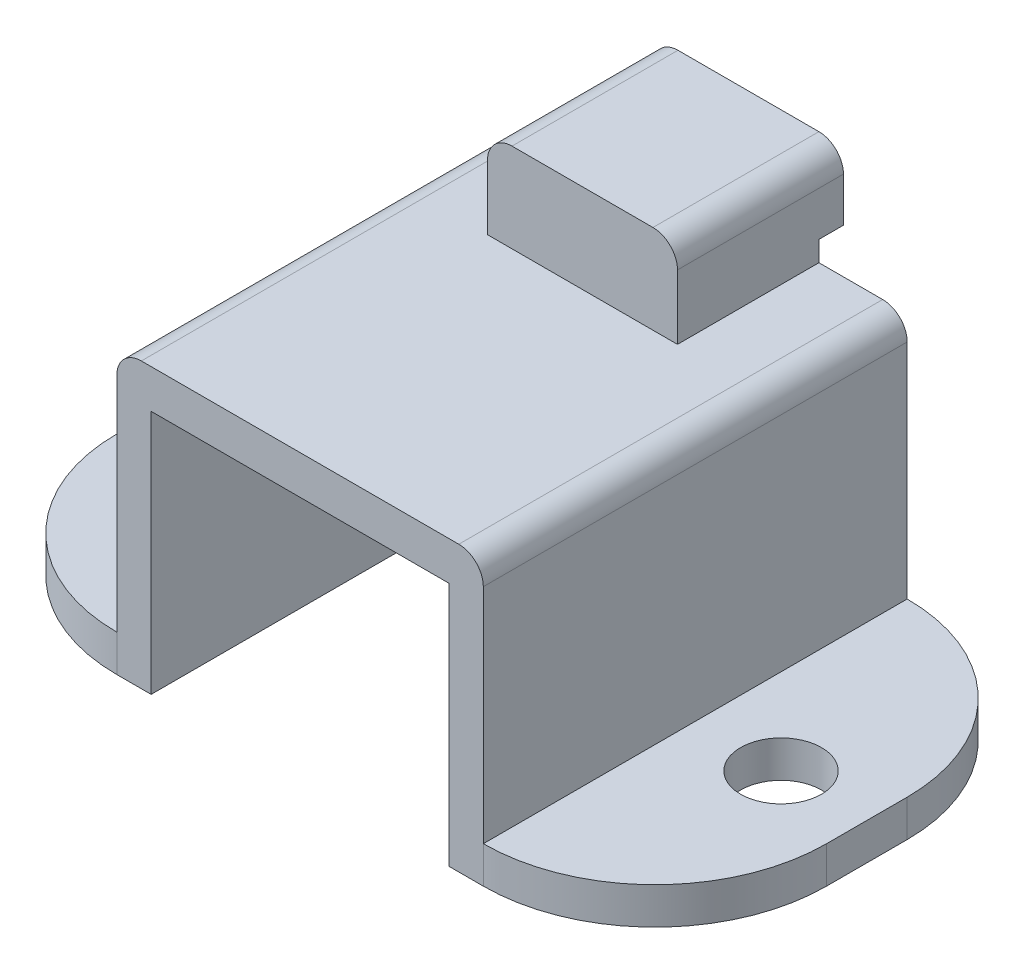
ISO-10303-21;
HEADER;
FILE_DESCRIPTION(('STEP AP214'),'2;1');
FILE_NAME('part.step','',(''),(''),'','','');
FILE_SCHEMA(('AUTOMOTIVE_DESIGN { 1 0 10303 214 1 1 1 1 }'));
ENDSEC;
DATA;
#1=APPLICATION_CONTEXT('core data for automotive mechanical design processes');
#2=APPLICATION_PROTOCOL_DEFINITION('international standard','automotive_design',2000,#1);
#3=PRODUCT_CONTEXT('',#1,'mechanical');
#4=PRODUCT('Part','Part','',(#3));
#5=PRODUCT_RELATED_PRODUCT_CATEGORY('part','',(#4));
#6=PRODUCT_DEFINITION_FORMATION('','',#4);
#7=PRODUCT_DEFINITION_CONTEXT('part definition',#1,'design');
#8=PRODUCT_DEFINITION('design','',#6,#7);
#9=PRODUCT_DEFINITION_SHAPE('','',#8);
#10=(LENGTH_UNIT() NAMED_UNIT(*) SI_UNIT(.MILLI.,.METRE.));
#11=(NAMED_UNIT(*) PLANE_ANGLE_UNIT() SI_UNIT($,.RADIAN.));
#12=(NAMED_UNIT(*) SI_UNIT($,.STERADIAN.) SOLID_ANGLE_UNIT());
#13=UNCERTAINTY_MEASURE_WITH_UNIT(LENGTH_MEASURE(1.E-05),#10,'distance_accuracy_value','');
#14=(GEOMETRIC_REPRESENTATION_CONTEXT(3) GLOBAL_UNCERTAINTY_ASSIGNED_CONTEXT((#13)) GLOBAL_UNIT_ASSIGNED_CONTEXT((#10,
#11,#12)) REPRESENTATION_CONTEXT('',''));
#15=CARTESIAN_POINT('',(0.,0.,0.));
#16=DIRECTION('',(0.,0.,1.));
#17=DIRECTION('',(1.,0.,0.));
#18=AXIS2_PLACEMENT_3D('',#15,#16,#17);
#19=CARTESIAN_POINT('',(0.,0.,-8.12));
#20=DIRECTION('',(0.,0.,-1.));
#21=DIRECTION('',(-1.,0.,0.));
#22=AXIS2_PLACEMENT_3D('',#19,#20,#21);
#23=PLANE('',#22);
#24=DIRECTION('',(0.,1.,0.));
#25=VECTOR('',#24,1.);
#26=CARTESIAN_POINT('',(-3.875,0.,-8.12));
#27=LINE('',#26,#25);
#28=CARTESIAN_POINT('',(-3.875,11.58,-8.12));
#29=VERTEX_POINT('',#28);
#30=CARTESIAN_POINT('',(-3.875,12.4038902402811,-8.12));
#31=VERTEX_POINT('',#30);
#32=EDGE_CURVE('E354',#29,#31,#27,.T.);
#33=ORIENTED_EDGE('',*,*,#32,.T.);
#34=DIRECTION('',(-1.,0.,0.));
#35=VECTOR('',#34,1.);
#36=CARTESIAN_POINT('',(0.,12.4038902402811,-8.12));
#37=LINE('',#36,#35);
#38=CARTESIAN_POINT('',(-2.375,12.4038902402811,-8.12));
#39=VERTEX_POINT('',#38);
#40=EDGE_CURVE('E57',#39,#31,#37,.T.);
#41=ORIENTED_EDGE('',*,*,#40,.F.);
#42=DIRECTION('',(0.,-1.,0.));
#43=VECTOR('',#42,1.);
#44=CARTESIAN_POINT('',(-2.375,0.,-8.12));
#45=LINE('',#44,#43);
#46=CARTESIAN_POINT('',(-2.375,10.,-8.12));
#47=VERTEX_POINT('',#46);
#48=EDGE_CURVE('E335',#39,#47,#45,.T.);
#49=ORIENTED_EDGE('',*,*,#48,.T.);
#50=DIRECTION('',(-1.,0.,0.));
#51=VECTOR('',#50,1.);
#52=CARTESIAN_POINT('',(0.,10.,-8.12));
#53=LINE('',#52,#51);
#54=CARTESIAN_POINT('',(-3.075,10.,-8.12));
#55=VERTEX_POINT('',#54);
#56=EDGE_CURVE('E339',#47,#55,#53,.T.);
#57=ORIENTED_EDGE('',*,*,#56,.T.);
#58=CARTESIAN_POINT('',(-3.075,7.,-8.12));
#59=DIRECTION('',(0.,0.,-1.));
#60=DIRECTION('',(-1.,0.,0.));
#61=AXIS2_PLACEMENT_3D('',#58,#59,#60);
#62=CIRCLE('',#61,3.);
#63=CARTESIAN_POINT('',(-6.075,7.,-8.12));
#64=VERTEX_POINT('',#63);
#65=EDGE_CURVE('E342',#55,#64,#62,.F.);
#66=ORIENTED_EDGE('',*,*,#65,.T.);
#67=DIRECTION('',(0.,-1.,0.));
#68=VECTOR('',#67,1.);
#69=CARTESIAN_POINT('',(-6.075,0.,-8.12));
#70=LINE('',#69,#68);
#71=CARTESIAN_POINT('',(-6.075,0.,-8.12));
#72=VERTEX_POINT('',#71);
#73=EDGE_CURVE('E345',#64,#72,#70,.T.);
#74=ORIENTED_EDGE('',*,*,#73,.T.);
#75=DIRECTION('',(-1.,0.,0.));
#76=VECTOR('',#75,1.);
#77=CARTESIAN_POINT('',(0.,0.,-8.12));
#78=LINE('',#77,#76);
#79=CARTESIAN_POINT('',(-7.475,0.,-8.12));
#80=VERTEX_POINT('',#79);
#81=EDGE_CURVE('E347',#72,#80,#78,.T.);
#82=ORIENTED_EDGE('',*,*,#81,.T.);
#83=DIRECTION('',(0.,-1.,0.));
#84=VECTOR('',#83,1.);
#85=CARTESIAN_POINT('',(-7.475,1.5,-8.12));
#86=LINE('',#85,#84);
#87=CARTESIAN_POINT('',(-7.475,1.5,-8.12));
#88=VERTEX_POINT('',#87);
#89=EDGE_CURVE('E523',#80,#88,#86,.F.);
#90=ORIENTED_EDGE('',*,*,#89,.T.);
#91=DIRECTION('',(0.,1.,0.));
#92=VECTOR('',#91,1.);
#93=CARTESIAN_POINT('',(-7.475,0.,-8.12));
#94=LINE('',#93,#92);
#95=CARTESIAN_POINT('',(-7.475,10.58,-8.12));
#96=VERTEX_POINT('',#95);
#97=EDGE_CURVE('E350',#88,#96,#94,.T.);
#98=ORIENTED_EDGE('',*,*,#97,.T.);
#99=CARTESIAN_POINT('',(-6.475,10.58,-8.12));
#100=DIRECTION('',(0.,0.,-1.));
#101=DIRECTION('',(-1.,0.,0.));
#102=AXIS2_PLACEMENT_3D('',#99,#100,#101);
#103=CIRCLE('',#102,1.);
#104=CARTESIAN_POINT('',(-6.475,11.58,-8.12));
#105=VERTEX_POINT('',#104);
#106=EDGE_CURVE('E465',#96,#105,#103,.T.);
#107=ORIENTED_EDGE('',*,*,#106,.T.);
#108=DIRECTION('',(1.,0.,0.));
#109=VECTOR('',#108,1.);
#110=CARTESIAN_POINT('',(0.,11.58,-8.12));
#111=LINE('',#110,#109);
#112=EDGE_CURVE('E352',#105,#29,#111,.T.);
#113=ORIENTED_EDGE('',*,*,#112,.T.);
#114=EDGE_LOOP('',(#33,#41,#49,#57,#66,#74,#82,#90,#98,#107,#113));
#115=FACE_BOUND('',#114,.T.);
#116=ADVANCED_FACE('F42',(#115),#23,.T.);
#117=CARTESIAN_POINT('',(-7.475,11.58,9.17));
#118=DIRECTION('',(1.,0.,0.));
#119=DIRECTION('',(0.,1.,0.));
#120=AXIS2_PLACEMENT_3D('',#117,#118,#119);
#121=PLANE('',#120);
#122=DIRECTION('',(0.,0.,-1.));
#123=VECTOR('',#122,1.);
#124=CARTESIAN_POINT('',(-7.475,1.5,9.17));
#125=LINE('',#124,#123);
#126=CARTESIAN_POINT('',(-7.475,1.5,9.17));
#127=VERTEX_POINT('',#126);
#128=EDGE_CURVE('E309',#127,#88,#125,.T.);
#129=ORIENTED_EDGE('',*,*,#128,.F.);
#130=DIRECTION('',(0.,-1.,0.));
#131=VECTOR('',#130,1.);
#132=CARTESIAN_POINT('',(-7.475,11.58,9.17));
#133=LINE('',#132,#131);
#134=CARTESIAN_POINT('',(-7.475,10.58,9.17));
#135=VERTEX_POINT('',#134);
#136=EDGE_CURVE('E437',#135,#127,#133,.T.);
#137=ORIENTED_EDGE('',*,*,#136,.F.);
#138=DIRECTION('',(0.,0.,-1.));
#139=VECTOR('',#138,1.);
#140=CARTESIAN_POINT('',(-7.475,10.58,9.17));
#141=LINE('',#140,#139);
#142=EDGE_CURVE('E476',#135,#96,#141,.T.);
#143=ORIENTED_EDGE('',*,*,#142,.T.);
#144=ORIENTED_EDGE('',*,*,#97,.F.);
#145=EDGE_LOOP('',(#129,#137,#143,#144));
#146=FACE_BOUND('',#145,.T.);
#147=ADVANCED_FACE('F610',(#146),#121,.F.);
#148=CARTESIAN_POINT('',(7.475,11.58,9.17));
#149=DIRECTION('',(-1.,0.,0.));
#150=DIRECTION('',(0.,-1.,0.));
#151=AXIS2_PLACEMENT_3D('',#148,#149,#150);
#152=PLANE('',#151);
#153=DIRECTION('',(0.,0.,1.));
#154=VECTOR('',#153,1.);
#155=CARTESIAN_POINT('',(7.475,1.5,9.17));
#156=LINE('',#155,#154);
#157=CARTESIAN_POINT('',(7.475,1.5,-8.12));
#158=VERTEX_POINT('',#157);
#159=CARTESIAN_POINT('',(7.475,1.5,9.17));
#160=VERTEX_POINT('',#159);
#161=EDGE_CURVE('E324',#158,#160,#156,.T.);
#162=ORIENTED_EDGE('',*,*,#161,.F.);
#163=DIRECTION('',(0.,-1.,0.));
#164=VECTOR('',#163,1.);
#165=CARTESIAN_POINT('',(7.475,0.,-8.12));
#166=LINE('',#165,#164);
#167=CARTESIAN_POINT('',(7.475,10.58,-8.12));
#168=VERTEX_POINT('',#167);
#169=EDGE_CURVE('E360',#168,#158,#166,.T.);
#170=ORIENTED_EDGE('',*,*,#169,.F.);
#171=DIRECTION('',(0.,0.,-1.));
#172=VECTOR('',#171,1.);
#173=CARTESIAN_POINT('',(7.475,10.58,9.17));
#174=LINE('',#173,#172);
#175=CARTESIAN_POINT('',(7.475,10.58,9.17));
#176=VERTEX_POINT('',#175);
#177=EDGE_CURVE('E469',#168,#176,#174,.F.);
#178=ORIENTED_EDGE('',*,*,#177,.T.);
#179=DIRECTION('',(0.,1.,0.));
#180=VECTOR('',#179,1.);
#181=CARTESIAN_POINT('',(7.475,11.58,9.17));
#182=LINE('',#181,#180);
#183=EDGE_CURVE('E432',#160,#176,#182,.T.);
#184=ORIENTED_EDGE('',*,*,#183,.F.);
#185=EDGE_LOOP('',(#162,#170,#178,#184));
#186=FACE_BOUND('',#185,.T.);
#187=ADVANCED_FACE('F577',(#186),#152,.F.);
#188=CARTESIAN_POINT('',(6.075,10.,9.17));
#189=DIRECTION('',(0.,1.,0.));
#190=DIRECTION('',(0.,0.,1.));
#191=AXIS2_PLACEMENT_3D('',#188,#189,#190);
#192=PLANE('',#191);
#193=DIRECTION('',(0.,0.,1.));
#194=VECTOR('',#193,1.);
#195=CARTESIAN_POINT('',(-3.075,10.,-2.35));
#196=LINE('',#195,#194);
#197=CARTESIAN_POINT('',(-3.075,10.,0.));
#198=VERTEX_POINT('',#197);
#199=EDGE_CURVE('E412',#55,#198,#196,.T.);
#200=ORIENTED_EDGE('',*,*,#199,.F.);
#201=ORIENTED_EDGE('',*,*,#56,.F.);
#202=DIRECTION('',(0.,0.,1.));
#203=VECTOR('',#202,1.);
#204=CARTESIAN_POINT('',(-2.375,10.,-8.12));
#205=LINE('',#204,#203);
#206=CARTESIAN_POINT('',(-2.375,10.,-3.42));
#207=VERTEX_POINT('',#206);
#208=EDGE_CURVE('E376',#47,#207,#205,.T.);
#209=ORIENTED_EDGE('',*,*,#208,.T.);
#210=DIRECTION('',(1.,0.,0.));
#211=VECTOR('',#210,1.);
#212=CARTESIAN_POINT('',(3.875,10.,-3.42));
#213=LINE('',#212,#211);
#214=CARTESIAN_POINT('',(2.375,10.,-3.42));
#215=VERTEX_POINT('',#214);
#216=EDGE_CURVE('E389',#207,#215,#213,.T.);
#217=ORIENTED_EDGE('',*,*,#216,.T.);
#218=DIRECTION('',(0.,0.,1.));
#219=VECTOR('',#218,1.);
#220=CARTESIAN_POINT('',(2.375,10.,-8.12));
#221=LINE('',#220,#219);
#222=CARTESIAN_POINT('',(2.375,10.,-8.12));
#223=VERTEX_POINT('',#222);
#224=EDGE_CURVE('E372',#223,#215,#221,.T.);
#225=ORIENTED_EDGE('',*,*,#224,.F.);
#226=DIRECTION('',(-1.,0.,0.));
#227=VECTOR('',#226,1.);
#228=CARTESIAN_POINT('',(0.,10.,-8.12));
#229=LINE('',#228,#227);
#230=CARTESIAN_POINT('',(3.075,10.,-8.12));
#231=VERTEX_POINT('',#230);
#232=EDGE_CURVE('E370',#231,#223,#229,.T.);
#233=ORIENTED_EDGE('',*,*,#232,.F.);
#234=DIRECTION('',(0.,0.,1.));
#235=VECTOR('',#234,1.);
#236=CARTESIAN_POINT('',(3.075,10.,-2.35));
#237=LINE('',#236,#235);
#238=CARTESIAN_POINT('',(3.075,10.,0.));
#239=VERTEX_POINT('',#238);
#240=EDGE_CURVE('E414',#231,#239,#237,.T.);
#241=ORIENTED_EDGE('',*,*,#240,.T.);
#242=DIRECTION('',(1.,0.,0.));
#243=VECTOR('',#242,1.);
#244=CARTESIAN_POINT('',(6.075,10.,0.));
#245=LINE('',#244,#243);
#246=CARTESIAN_POINT('',(6.075,10.,0.));
#247=VERTEX_POINT('',#246);
#248=EDGE_CURVE('E443',#239,#247,#245,.T.);
#249=ORIENTED_EDGE('',*,*,#248,.T.);
#250=DIRECTION('',(0.,0.,-1.));
#251=VECTOR('',#250,1.);
#252=CARTESIAN_POINT('',(6.075,10.,9.17));
#253=LINE('',#252,#251);
#254=CARTESIAN_POINT('',(6.075,10.,9.17));
#255=VERTEX_POINT('',#254);
#256=EDGE_CURVE('E451',#255,#247,#253,.T.);
#257=ORIENTED_EDGE('',*,*,#256,.F.);
#258=DIRECTION('',(1.,0.,0.));
#259=VECTOR('',#258,1.);
#260=CARTESIAN_POINT('',(6.075,10.,9.17));
#261=LINE('',#260,#259);
#262=CARTESIAN_POINT('',(-6.075,10.,9.17));
#263=VERTEX_POINT('',#262);
#264=EDGE_CURVE('E425',#263,#255,#261,.T.);
#265=ORIENTED_EDGE('',*,*,#264,.F.);
#266=DIRECTION('',(0.,0.,-1.));
#267=VECTOR('',#266,1.);
#268=CARTESIAN_POINT('',(-6.075,10.,9.17));
#269=LINE('',#268,#267);
#270=CARTESIAN_POINT('',(-6.075,10.,0.));
#271=VERTEX_POINT('',#270);
#272=EDGE_CURVE('E454',#263,#271,#269,.T.);
#273=ORIENTED_EDGE('',*,*,#272,.T.);
#274=EDGE_CURVE('E444',#271,#198,#245,.T.);
#275=ORIENTED_EDGE('',*,*,#274,.T.);
#276=EDGE_LOOP('',(#200,#201,#209,#217,#225,#233,#241,#249,#257,#265,#273,#275));
#277=FACE_BOUND('',#276,.T.);
#278=ADVANCED_FACE('F633',(#277),#192,.F.);
#279=CARTESIAN_POINT('',(-3.875,10.,-2.35));
#280=DIRECTION('',(1.,0.,0.));
#281=DIRECTION('',(0.,1.,0.));
#282=AXIS2_PLACEMENT_3D('',#279,#280,#281);
#283=PLANE('',#282);
#284=DIRECTION('',(0.,-1.,0.));
#285=VECTOR('',#284,1.);
#286=CARTESIAN_POINT('',(-3.875,10.,-2.35));
#287=LINE('',#286,#285);
#288=CARTESIAN_POINT('',(-3.875,14.21,-2.35));
#289=VERTEX_POINT('',#288);
#290=CARTESIAN_POINT('',(-3.875,11.58,-2.35));
#291=VERTEX_POINT('',#290);
#292=EDGE_CURVE('E390',#289,#291,#287,.T.);
#293=ORIENTED_EDGE('',*,*,#292,.F.);
#294=DIRECTION('',(0.,0.,-1.));
#295=VECTOR('',#294,1.);
#296=CARTESIAN_POINT('',(-3.875,14.21,-2.35));
#297=LINE('',#296,#295);
#298=CARTESIAN_POINT('',(-3.875,14.21,-9.12));
#299=VERTEX_POINT('',#298);
#300=EDGE_CURVE('E479',#289,#299,#297,.T.);
#301=ORIENTED_EDGE('',*,*,#300,.T.);
#302=DIRECTION('',(0.,1.,0.));
#303=VECTOR('',#302,1.);
#304=CARTESIAN_POINT('',(-3.875,0.,-9.12));
#305=LINE('',#304,#303);
#306=CARTESIAN_POINT('',(-3.875,12.4038902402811,-9.12));
#307=VERTEX_POINT('',#306);
#308=EDGE_CURVE('E279',#307,#299,#305,.T.);
#309=ORIENTED_EDGE('',*,*,#308,.F.);
#310=DIRECTION('',(0.,0.,1.));
#311=VECTOR('',#310,1.);
#312=CARTESIAN_POINT('',(-3.875,12.4038902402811,-9.12));
#313=LINE('',#312,#311);
#314=EDGE_CURVE('E275',#307,#31,#313,.T.);
#315=ORIENTED_EDGE('',*,*,#314,.T.);
#316=ORIENTED_EDGE('',*,*,#32,.F.);
#317=DIRECTION('',(0.,0.,-1.));
#318=VECTOR('',#317,1.);
#319=CARTESIAN_POINT('',(-3.875,11.58,-2.35));
#320=LINE('',#319,#318);
#321=EDGE_CURVE('E375',#291,#29,#320,.T.);
#322=ORIENTED_EDGE('',*,*,#321,.F.);
#323=EDGE_LOOP('',(#293,#301,#309,#315,#316,#322));
#324=FACE_BOUND('',#323,.T.);
#325=ADVANCED_FACE('F601',(#324),#283,.F.);
#326=CARTESIAN_POINT('',(3.875,15.21,-2.35));
#327=DIRECTION('',(-1.,0.,0.));
#328=DIRECTION('',(0.,-1.,0.));
#329=AXIS2_PLACEMENT_3D('',#326,#327,#328);
#330=PLANE('',#329);
#331=DIRECTION('',(0.,1.,0.));
#332=VECTOR('',#331,1.);
#333=CARTESIAN_POINT('',(3.875,0.,-8.12));
#334=LINE('',#333,#332);
#335=CARTESIAN_POINT('',(3.875,11.58,-8.12));
#336=VERTEX_POINT('',#335);
#337=CARTESIAN_POINT('',(3.875,12.4038902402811,-8.12));
#338=VERTEX_POINT('',#337);
#339=EDGE_CURVE('E294',#336,#338,#334,.T.);
#340=ORIENTED_EDGE('',*,*,#339,.T.);
#341=DIRECTION('',(0.,0.,1.));
#342=VECTOR('',#341,1.);
#343=CARTESIAN_POINT('',(3.875,12.4038902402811,-9.12));
#344=LINE('',#343,#342);
#345=CARTESIAN_POINT('',(3.875,12.4038902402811,-9.12));
#346=VERTEX_POINT('',#345);
#347=EDGE_CURVE('E273',#346,#338,#344,.T.);
#348=ORIENTED_EDGE('',*,*,#347,.F.);
#349=DIRECTION('',(0.,-1.,0.));
#350=VECTOR('',#349,1.);
#351=CARTESIAN_POINT('',(3.875,0.,-9.12));
#352=LINE('',#351,#350);
#353=CARTESIAN_POINT('',(3.875,14.21,-9.12));
#354=VERTEX_POINT('',#353);
#355=EDGE_CURVE('E280',#354,#346,#352,.T.);
#356=ORIENTED_EDGE('',*,*,#355,.F.);
#357=DIRECTION('',(0.,0.,-1.));
#358=VECTOR('',#357,1.);
#359=CARTESIAN_POINT('',(3.875,14.21,-2.35));
#360=LINE('',#359,#358);
#361=CARTESIAN_POINT('',(3.875,14.21,-2.35));
#362=VERTEX_POINT('',#361);
#363=EDGE_CURVE('E489',#354,#362,#360,.F.);
#364=ORIENTED_EDGE('',*,*,#363,.T.);
#365=DIRECTION('',(0.,1.,0.));
#366=VECTOR('',#365,1.);
#367=CARTESIAN_POINT('',(3.875,15.21,-2.35));
#368=LINE('',#367,#366);
#369=CARTESIAN_POINT('',(3.875,11.58,-2.35));
#370=VERTEX_POINT('',#369);
#371=EDGE_CURVE('E392',#370,#362,#368,.T.);
#372=ORIENTED_EDGE('',*,*,#371,.F.);
#373=DIRECTION('',(0.,0.,1.));
#374=VECTOR('',#373,1.);
#375=CARTESIAN_POINT('',(3.875,11.58,-8.12));
#376=LINE('',#375,#374);
#377=EDGE_CURVE('E383',#336,#370,#376,.T.);
#378=ORIENTED_EDGE('',*,*,#377,.F.);
#379=EDGE_LOOP('',(#340,#348,#356,#364,#372,#378));
#380=FACE_BOUND('',#379,.T.);
#381=ADVANCED_FACE('F292',(#380),#330,.F.);
#382=CARTESIAN_POINT('',(-7.475,0.,9.17));
#383=DIRECTION('',(0.,1.,0.));
#384=DIRECTION('',(-1.,0.,0.));
#385=AXIS2_PLACEMENT_3D('',#382,#383,#384);
#386=PLANE('',#385);
#387=DIRECTION('',(0.,0.,1.));
#388=VECTOR('',#387,1.);
#389=CARTESIAN_POINT('',(-14.475,0.,9.17));
#390=LINE('',#389,#388);
#391=CARTESIAN_POINT('',(-14.475,0.,-1.12));
#392=VERTEX_POINT('',#391);
#393=CARTESIAN_POINT('',(-14.475,0.,2.17));
#394=VERTEX_POINT('',#393);
#395=EDGE_CURVE('E304',#392,#394,#390,.T.);
#396=ORIENTED_EDGE('',*,*,#395,.F.);
#397=CARTESIAN_POINT('',(-7.475,0.,-1.12));
#398=DIRECTION('',(0.,1.,0.));
#399=DIRECTION('',(-1.,0.,0.));
#400=AXIS2_PLACEMENT_3D('',#397,#398,#399);
#401=CIRCLE('',#400,7.);
#402=EDGE_CURVE('E518',#392,#80,#401,.F.);
#403=ORIENTED_EDGE('',*,*,#402,.T.);
#404=ORIENTED_EDGE('',*,*,#81,.F.);
#405=DIRECTION('',(0.,0.,-1.));
#406=VECTOR('',#405,1.);
#407=CARTESIAN_POINT('',(-6.075,0.,9.17));
#408=LINE('',#407,#406);
#409=CARTESIAN_POINT('',(-6.075,0.,9.17));
#410=VERTEX_POINT('',#409);
#411=EDGE_CURVE('E457',#410,#72,#408,.T.);
#412=ORIENTED_EDGE('',*,*,#411,.F.);
#413=DIRECTION('',(1.,0.,0.));
#414=VECTOR('',#413,1.);
#415=CARTESIAN_POINT('',(-7.475,0.,9.17));
#416=LINE('',#415,#414);
#417=CARTESIAN_POINT('',(-7.475,0.,9.17));
#418=VERTEX_POINT('',#417);
#419=EDGE_CURVE('E420',#418,#410,#416,.T.);
#420=ORIENTED_EDGE('',*,*,#419,.F.);
#421=CARTESIAN_POINT('',(-7.475,0.,2.17));
#422=DIRECTION('',(0.,1.,0.));
#423=DIRECTION('',(-1.,0.,0.));
#424=AXIS2_PLACEMENT_3D('',#421,#422,#423);
#425=CIRCLE('',#424,7.);
#426=EDGE_CURVE('E516',#418,#394,#425,.F.);
#427=ORIENTED_EDGE('',*,*,#426,.T.);
#428=EDGE_LOOP('',(#396,#403,#404,#412,#420,#427));
#429=FACE_BOUND('',#428,.T.);
#430=CARTESIAN_POINT('',(-10.975,0.,0.524999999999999));
#431=DIRECTION('',(0.,1.,0.));
#432=DIRECTION('',(-1.,0.,0.));
#433=AXIS2_PLACEMENT_3D('',#430,#431,#432);
#434=CIRCLE('',#433,1.65);
#435=CARTESIAN_POINT('',(-12.625,0.,0.524999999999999));
#436=VERTEX_POINT('',#435);
#437=EDGE_CURVE('E295',#436,#436,#434,.T.);
#438=ORIENTED_EDGE('',*,*,#437,.T.);
#439=EDGE_LOOP('',(#438));
#440=FACE_BOUND('',#439,.T.);
#441=ADVANCED_FACE('F625',(#429,#440),#386,.F.);
#442=CARTESIAN_POINT('',(-6.075,0.,9.17));
#443=DIRECTION('',(-1.,0.,0.));
#444=DIRECTION('',(0.,0.,1.));
#445=AXIS2_PLACEMENT_3D('',#442,#443,#444);
#446=PLANE('',#445);
#447=ORIENTED_EDGE('',*,*,#411,.T.);
#448=ORIENTED_EDGE('',*,*,#73,.F.);
#449=DIRECTION('',(0.,0.,1.));
#450=VECTOR('',#449,1.);
#451=CARTESIAN_POINT('',(-6.075,7.,-2.35));
#452=LINE('',#451,#450);
#453=CARTESIAN_POINT('',(-6.075,7.,0.));
#454=VERTEX_POINT('',#453);
#455=EDGE_CURVE('E404',#64,#454,#452,.T.);
#456=ORIENTED_EDGE('',*,*,#455,.T.);
#457=DIRECTION('',(0.,1.,0.));
#458=VECTOR('',#457,1.);
#459=CARTESIAN_POINT('',(-6.075,0.,0.));
#460=LINE('',#459,#458);
#461=EDGE_CURVE('E419',#454,#271,#460,.T.);
#462=ORIENTED_EDGE('',*,*,#461,.T.);
#463=ORIENTED_EDGE('',*,*,#272,.F.);
#464=DIRECTION('',(0.,1.,0.));
#465=VECTOR('',#464,1.);
#466=CARTESIAN_POINT('',(-6.075,0.,9.17));
#467=LINE('',#466,#465);
#468=EDGE_CURVE('E422',#410,#263,#467,.T.);
#469=ORIENTED_EDGE('',*,*,#468,.F.);
#470=EDGE_LOOP('',(#447,#448,#456,#462,#463,#469));
#471=FACE_BOUND('',#470,.T.);
#472=ADVANCED_FACE('F630',(#471),#446,.F.);
#473=CARTESIAN_POINT('',(6.075,0.,9.17));
#474=DIRECTION('',(1.,0.,0.));
#475=DIRECTION('',(0.,0.,-1.));
#476=AXIS2_PLACEMENT_3D('',#473,#474,#475);
#477=PLANE('',#476);
#478=DIRECTION('',(0.,0.,-1.));
#479=VECTOR('',#478,1.);
#480=CARTESIAN_POINT('',(6.075,0.,9.17));
#481=LINE('',#480,#479);
#482=CARTESIAN_POINT('',(6.075,0.,9.17));
#483=VERTEX_POINT('',#482);
#484=CARTESIAN_POINT('',(6.075,0.,-8.12));
#485=VERTEX_POINT('',#484);
#486=EDGE_CURVE('E440',#483,#485,#481,.T.);
#487=ORIENTED_EDGE('',*,*,#486,.F.);
#488=DIRECTION('',(0.,-1.,0.));
#489=VECTOR('',#488,1.);
#490=CARTESIAN_POINT('',(6.075,0.,9.17));
#491=LINE('',#490,#489);
#492=EDGE_CURVE('E427',#255,#483,#491,.T.);
#493=ORIENTED_EDGE('',*,*,#492,.F.);
#494=ORIENTED_EDGE('',*,*,#256,.T.);
#495=DIRECTION('',(0.,-1.,0.));
#496=VECTOR('',#495,1.);
#497=CARTESIAN_POINT('',(6.075,0.,0.));
#498=LINE('',#497,#496);
#499=CARTESIAN_POINT('',(6.075,7.,0.));
#500=VERTEX_POINT('',#499);
#501=EDGE_CURVE('E423',#247,#500,#498,.T.);
#502=ORIENTED_EDGE('',*,*,#501,.T.);
#503=DIRECTION('',(0.,0.,1.));
#504=VECTOR('',#503,1.);
#505=CARTESIAN_POINT('',(6.075,7.,-2.35));
#506=LINE('',#505,#504);
#507=CARTESIAN_POINT('',(6.075,7.,-8.12));
#508=VERTEX_POINT('',#507);
#509=EDGE_CURVE('E417',#508,#500,#506,.T.);
#510=ORIENTED_EDGE('',*,*,#509,.F.);
#511=DIRECTION('',(0.,1.,0.));
#512=VECTOR('',#511,1.);
#513=CARTESIAN_POINT('',(6.075,0.,-8.12));
#514=LINE('',#513,#512);
#515=EDGE_CURVE('E365',#485,#508,#514,.T.);
#516=ORIENTED_EDGE('',*,*,#515,.F.);
#517=EDGE_LOOP('',(#487,#493,#494,#502,#510,#516));
#518=FACE_BOUND('',#517,.T.);
#519=ADVANCED_FACE('F569',(#518),#477,.F.);
#520=CARTESIAN_POINT('',(6.075,0.,9.17));
#521=DIRECTION('',(0.,1.,0.));
#522=DIRECTION('',(-1.,0.,0.));
#523=AXIS2_PLACEMENT_3D('',#520,#521,#522);
#524=PLANE('',#523);
#525=DIRECTION('',(-1.,0.,0.));
#526=VECTOR('',#525,1.);
#527=CARTESIAN_POINT('',(0.,0.,-8.12));
#528=LINE('',#527,#526);
#529=CARTESIAN_POINT('',(7.475,0.,-8.12));
#530=VERTEX_POINT('',#529);
#531=EDGE_CURVE('E363',#530,#485,#528,.T.);
#532=ORIENTED_EDGE('',*,*,#531,.F.);
#533=CARTESIAN_POINT('',(7.475,0.,-1.12));
#534=DIRECTION('',(0.,1.,0.));
#535=DIRECTION('',(-1.,0.,0.));
#536=AXIS2_PLACEMENT_3D('',#533,#534,#535);
#537=CIRCLE('',#536,7.);
#538=CARTESIAN_POINT('',(14.475,0.,-1.12));
#539=VERTEX_POINT('',#538);
#540=EDGE_CURVE('E536',#530,#539,#537,.F.);
#541=ORIENTED_EDGE('',*,*,#540,.T.);
#542=DIRECTION('',(0.,0.,1.));
#543=VECTOR('',#542,1.);
#544=CARTESIAN_POINT('',(14.475,0.,9.17));
#545=LINE('',#544,#543);
#546=CARTESIAN_POINT('',(14.475,0.,2.17));
#547=VERTEX_POINT('',#546);
#548=EDGE_CURVE('E318',#539,#547,#545,.T.);
#549=ORIENTED_EDGE('',*,*,#548,.T.);
#550=CARTESIAN_POINT('',(7.475,0.,2.17));
#551=DIRECTION('',(0.,1.,0.));
#552=DIRECTION('',(-1.,0.,0.));
#553=AXIS2_PLACEMENT_3D('',#550,#551,#552);
#554=CIRCLE('',#553,7.);
#555=CARTESIAN_POINT('',(7.475,0.,9.17));
#556=VERTEX_POINT('',#555);
#557=EDGE_CURVE('E534',#547,#556,#554,.F.);
#558=ORIENTED_EDGE('',*,*,#557,.T.);
#559=DIRECTION('',(1.,0.,0.));
#560=VECTOR('',#559,1.);
#561=CARTESIAN_POINT('',(6.075,0.,9.17));
#562=LINE('',#561,#560);
#563=EDGE_CURVE('E429',#483,#556,#562,.T.);
#564=ORIENTED_EDGE('',*,*,#563,.F.);
#565=ORIENTED_EDGE('',*,*,#486,.T.);
#566=EDGE_LOOP('',(#532,#541,#549,#558,#564,#565));
#567=FACE_BOUND('',#566,.T.);
#568=CARTESIAN_POINT('',(10.975,0.,0.524999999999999));
#569=DIRECTION('',(0.,-1.,0.));
#570=DIRECTION('',(1.,0.,0.));
#571=AXIS2_PLACEMENT_3D('',#568,#569,#570);
#572=CIRCLE('',#571,1.65);
#573=CARTESIAN_POINT('',(12.625,0.,0.524999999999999));
#574=VERTEX_POINT('',#573);
#575=EDGE_CURVE('E314',#574,#574,#572,.T.);
#576=ORIENTED_EDGE('',*,*,#575,.F.);
#577=EDGE_LOOP('',(#576));
#578=FACE_BOUND('',#577,.T.);
#579=ADVANCED_FACE('F558',(#567,#578),#524,.F.);
#580=CARTESIAN_POINT('',(-7.475,11.58,9.17));
#581=DIRECTION('',(0.,-1.,0.));
#582=DIRECTION('',(0.,0.,-1.));
#583=AXIS2_PLACEMENT_3D('',#580,#581,#582);
#584=PLANE('',#583);
#585=DIRECTION('',(-1.,0.,0.));
#586=VECTOR('',#585,1.);
#587=CARTESIAN_POINT('',(-7.475,11.58,9.17));
#588=LINE('',#587,#586);
#589=CARTESIAN_POINT('',(6.475,11.58,9.17));
#590=VERTEX_POINT('',#589);
#591=CARTESIAN_POINT('',(-6.475,11.58,9.17));
#592=VERTEX_POINT('',#591);
#593=EDGE_CURVE('E434',#590,#592,#588,.T.);
#594=ORIENTED_EDGE('',*,*,#593,.F.);
#595=DIRECTION('',(0.,0.,-1.));
#596=VECTOR('',#595,1.);
#597=CARTESIAN_POINT('',(6.475,11.58,9.17));
#598=LINE('',#597,#596);
#599=CARTESIAN_POINT('',(6.475,11.58,-8.12));
#600=VERTEX_POINT('',#599);
#601=EDGE_CURVE('E462',#590,#600,#598,.T.);
#602=ORIENTED_EDGE('',*,*,#601,.T.);
#603=DIRECTION('',(1.,0.,0.));
#604=VECTOR('',#603,1.);
#605=CARTESIAN_POINT('',(0.,11.58,-8.12));
#606=LINE('',#605,#604);
#607=EDGE_CURVE('E357',#336,#600,#606,.T.);
#608=ORIENTED_EDGE('',*,*,#607,.F.);
#609=ORIENTED_EDGE('',*,*,#377,.T.);
#610=DIRECTION('',(1.,0.,0.));
#611=VECTOR('',#610,1.);
#612=CARTESIAN_POINT('',(-7.475,11.58,-2.35));
#613=LINE('',#612,#611);
#614=EDGE_CURVE('E401',#291,#370,#613,.T.);
#615=ORIENTED_EDGE('',*,*,#614,.F.);
#616=ORIENTED_EDGE('',*,*,#321,.T.);
#617=ORIENTED_EDGE('',*,*,#112,.F.);
#618=DIRECTION('',(0.,0.,-1.));
#619=VECTOR('',#618,1.);
#620=CARTESIAN_POINT('',(-6.475,11.58,9.17));
#621=LINE('',#620,#619);
#622=EDGE_CURVE('E460',#105,#592,#621,.F.);
#623=ORIENTED_EDGE('',*,*,#622,.T.);
#624=EDGE_LOOP('',(#594,#602,#608,#609,#615,#616,#617,#623));
#625=FACE_BOUND('',#624,.T.);
#626=ADVANCED_FACE('F585',(#625),#584,.F.);
#627=CARTESIAN_POINT('',(0.,0.,9.17));
#628=DIRECTION('',(0.,0.,1.));
#629=DIRECTION('',(1.,0.,0.));
#630=AXIS2_PLACEMENT_3D('',#627,#628,#629);
#631=PLANE('',#630);
#632=ORIENTED_EDGE('',*,*,#136,.T.);
#633=DIRECTION('',(0.,-1.,0.));
#634=VECTOR('',#633,1.);
#635=CARTESIAN_POINT('',(-7.475,0.,9.17));
#636=LINE('',#635,#634);
#637=EDGE_CURVE('E531',#127,#418,#636,.T.);
#638=ORIENTED_EDGE('',*,*,#637,.T.);
#639=ORIENTED_EDGE('',*,*,#419,.T.);
#640=ORIENTED_EDGE('',*,*,#468,.T.);
#641=ORIENTED_EDGE('',*,*,#264,.T.);
#642=ORIENTED_EDGE('',*,*,#492,.T.);
#643=ORIENTED_EDGE('',*,*,#563,.T.);
#644=DIRECTION('',(0.,-1.,0.));
#645=VECTOR('',#644,1.);
#646=CARTESIAN_POINT('',(7.475,0.,9.17));
#647=LINE('',#646,#645);
#648=EDGE_CURVE('E529',#556,#160,#647,.F.);
#649=ORIENTED_EDGE('',*,*,#648,.T.);
#650=ORIENTED_EDGE('',*,*,#183,.T.);
#651=CARTESIAN_POINT('',(6.475,10.58,9.17));
#652=DIRECTION('',(0.,0.,1.));
#653=DIRECTION('',(1.,0.,0.));
#654=AXIS2_PLACEMENT_3D('',#651,#652,#653);
#655=CIRCLE('',#654,1.);
#656=EDGE_CURVE('E474',#176,#590,#655,.T.);
#657=ORIENTED_EDGE('',*,*,#656,.T.);
#658=ORIENTED_EDGE('',*,*,#593,.T.);
#659=CARTESIAN_POINT('',(-6.475,10.58,9.17));
#660=DIRECTION('',(0.,0.,1.));
#661=DIRECTION('',(1.,0.,0.));
#662=AXIS2_PLACEMENT_3D('',#659,#660,#661);
#663=CIRCLE('',#662,1.);
#664=EDGE_CURVE('E472',#592,#135,#663,.T.);
#665=ORIENTED_EDGE('',*,*,#664,.T.);
#666=EDGE_LOOP('',(#632,#638,#639,#640,#641,#642,#643,#649,#650,#657,#658,#665));
#667=FACE_BOUND('',#666,.T.);
#668=ADVANCED_FACE('F561',(#667),#631,.T.);
#669=CARTESIAN_POINT('',(3.075,7.,0.));
#670=DIRECTION('',(0.,0.,1.));
#671=DIRECTION('',(1.,0.,0.));
#672=AXIS2_PLACEMENT_3D('',#669,#670,#671);
#673=PLANE('',#672);
#674=ORIENTED_EDGE('',*,*,#501,.F.);
#675=ORIENTED_EDGE('',*,*,#248,.F.);
#676=CARTESIAN_POINT('',(3.075,7.,0.));
#677=DIRECTION('',(0.,0.,1.));
#678=DIRECTION('',(1.,0.,0.));
#679=AXIS2_PLACEMENT_3D('',#676,#677,#678);
#680=CIRCLE('',#679,3.);
#681=EDGE_CURVE('E398',#500,#239,#680,.T.);
#682=ORIENTED_EDGE('',*,*,#681,.F.);
#683=EDGE_LOOP('',(#674,#675,#682));
#684=FACE_BOUND('',#683,.T.);
#685=ADVANCED_FACE('F638',(#684),#673,.T.);
#686=CARTESIAN_POINT('',(3.075,7.,-2.35));
#687=DIRECTION('',(0.,0.,1.));
#688=DIRECTION('',(1.,0.,0.));
#689=AXIS2_PLACEMENT_3D('',#686,#687,#688);
#690=CYLINDRICAL_SURFACE('',#689,3.);
#691=ORIENTED_EDGE('',*,*,#681,.T.);
#692=ORIENTED_EDGE('',*,*,#240,.F.);
#693=CARTESIAN_POINT('',(3.075,7.,-8.12));
#694=DIRECTION('',(0.,0.,-1.));
#695=DIRECTION('',(-1.,0.,0.));
#696=AXIS2_PLACEMENT_3D('',#693,#694,#695);
#697=CIRCLE('',#696,3.);
#698=EDGE_CURVE('E367',#508,#231,#697,.F.);
#699=ORIENTED_EDGE('',*,*,#698,.F.);
#700=ORIENTED_EDGE('',*,*,#509,.T.);
#701=EDGE_LOOP('',(#691,#692,#699,#700));
#702=FACE_BOUND('',#701,.T.);
#703=ADVANCED_FACE('F640',(#702),#690,.F.);
#704=CARTESIAN_POINT('',(-3.075,7.,-2.35));
#705=DIRECTION('',(0.,0.,1.));
#706=DIRECTION('',(1.,0.,0.));
#707=AXIS2_PLACEMENT_3D('',#704,#705,#706);
#708=CYLINDRICAL_SURFACE('',#707,3.);
#709=CARTESIAN_POINT('',(-3.075,7.,0.));
#710=DIRECTION('',(0.,0.,1.));
#711=DIRECTION('',(1.,0.,0.));
#712=AXIS2_PLACEMENT_3D('',#709,#710,#711);
#713=CIRCLE('',#712,3.);
#714=EDGE_CURVE('E405',#198,#454,#713,.T.);
#715=ORIENTED_EDGE('',*,*,#714,.T.);
#716=ORIENTED_EDGE('',*,*,#455,.F.);
#717=ORIENTED_EDGE('',*,*,#65,.F.);
#718=ORIENTED_EDGE('',*,*,#199,.T.);
#719=EDGE_LOOP('',(#715,#716,#717,#718));
#720=FACE_BOUND('',#719,.T.);
#721=ADVANCED_FACE('F721',(#720),#708,.F.);
#722=ORIENTED_EDGE('',*,*,#274,.F.);
#723=ORIENTED_EDGE('',*,*,#461,.F.);
#724=ORIENTED_EDGE('',*,*,#714,.F.);
#725=EDGE_LOOP('',(#722,#723,#724));
#726=FACE_BOUND('',#725,.T.);
#727=ADVANCED_FACE('F709',(#726),#673,.T.);
#728=CARTESIAN_POINT('',(0.,0.,-2.35));
#729=DIRECTION('',(0.,0.,-1.));
#730=DIRECTION('',(-1.,0.,0.));
#731=AXIS2_PLACEMENT_3D('',#728,#729,#730);
#732=PLANE('',#731);
#733=DIRECTION('',(-1.,0.,0.));
#734=VECTOR('',#733,1.);
#735=CARTESIAN_POINT('',(-3.875,15.21,-2.35));
#736=LINE('',#735,#734);
#737=CARTESIAN_POINT('',(2.875,15.21,-2.35));
#738=VERTEX_POINT('',#737);
#739=CARTESIAN_POINT('',(-2.875,15.21,-2.35));
#740=VERTEX_POINT('',#739);
#741=EDGE_CURVE('E395',#738,#740,#736,.T.);
#742=ORIENTED_EDGE('',*,*,#741,.T.);
#743=CARTESIAN_POINT('',(-2.875,14.21,-2.35));
#744=DIRECTION('',(0.,0.,-1.));
#745=DIRECTION('',(-1.,0.,0.));
#746=AXIS2_PLACEMENT_3D('',#743,#744,#745);
#747=CIRCLE('',#746,1.);
#748=EDGE_CURVE('E487',#740,#289,#747,.F.);
#749=ORIENTED_EDGE('',*,*,#748,.T.);
#750=ORIENTED_EDGE('',*,*,#292,.T.);
#751=ORIENTED_EDGE('',*,*,#614,.T.);
#752=ORIENTED_EDGE('',*,*,#371,.T.);
#753=CARTESIAN_POINT('',(2.875,14.21,-2.35));
#754=DIRECTION('',(0.,0.,-1.));
#755=DIRECTION('',(-1.,0.,0.));
#756=AXIS2_PLACEMENT_3D('',#753,#754,#755);
#757=CIRCLE('',#756,1.);
#758=EDGE_CURVE('E485',#362,#738,#757,.F.);
#759=ORIENTED_EDGE('',*,*,#758,.T.);
#760=EDGE_LOOP('',(#742,#749,#750,#751,#752,#759));
#761=FACE_BOUND('',#760,.T.);
#762=ADVANCED_FACE('F594',(#761),#732,.F.);
#763=CARTESIAN_POINT('',(-3.875,15.21,-2.35));
#764=DIRECTION('',(0.,-1.,0.));
#765=DIRECTION('',(0.,0.,-1.));
#766=AXIS2_PLACEMENT_3D('',#763,#764,#765);
#767=PLANE('',#766);
#768=DIRECTION('',(0.,0.,-1.));
#769=VECTOR('',#768,1.);
#770=CARTESIAN_POINT('',(2.875,15.21,-2.35));
#771=LINE('',#770,#769);
#772=CARTESIAN_POINT('',(2.875,15.21,-9.12));
#773=VERTEX_POINT('',#772);
#774=EDGE_CURVE('E481',#738,#773,#771,.T.);
#775=ORIENTED_EDGE('',*,*,#774,.T.);
#776=DIRECTION('',(1.,0.,0.));
#777=VECTOR('',#776,1.);
#778=CARTESIAN_POINT('',(0.,15.21,-9.12));
#779=LINE('',#778,#777);
#780=CARTESIAN_POINT('',(-2.875,15.21,-9.12));
#781=VERTEX_POINT('',#780);
#782=EDGE_CURVE('E660',#781,#773,#779,.T.);
#783=ORIENTED_EDGE('',*,*,#782,.F.);
#784=DIRECTION('',(0.,0.,-1.));
#785=VECTOR('',#784,1.);
#786=CARTESIAN_POINT('',(-2.875,15.21,-2.35));
#787=LINE('',#786,#785);
#788=EDGE_CURVE('E483',#781,#740,#787,.F.);
#789=ORIENTED_EDGE('',*,*,#788,.T.);
#790=ORIENTED_EDGE('',*,*,#741,.F.);
#791=EDGE_LOOP('',(#775,#783,#789,#790));
#792=FACE_BOUND('',#791,.T.);
#793=ADVANCED_FACE('F669',(#792),#767,.F.);
#794=CARTESIAN_POINT('',(0.,0.,-3.42));
#795=DIRECTION('',(0.,0.,-1.));
#796=DIRECTION('',(-1.,0.,0.));
#797=AXIS2_PLACEMENT_3D('',#794,#795,#796);
#798=PLANE('',#797);
#799=DIRECTION('',(0.,-1.,0.));
#800=VECTOR('',#799,1.);
#801=CARTESIAN_POINT('',(-2.375,0.,-3.42));
#802=LINE('',#801,#800);
#803=CARTESIAN_POINT('',(-2.375,12.61,-3.42));
#804=VERTEX_POINT('',#803);
#805=EDGE_CURVE('E379',#804,#207,#802,.T.);
#806=ORIENTED_EDGE('',*,*,#805,.F.);
#807=CARTESIAN_POINT('',(-1.375,12.61,-3.42));
#808=DIRECTION('',(0.,0.,-1.));
#809=DIRECTION('',(-1.,0.,0.));
#810=AXIS2_PLACEMENT_3D('',#807,#808,#809);
#811=CIRCLE('',#810,1.);
#812=CARTESIAN_POINT('',(-1.375,13.61,-3.42));
#813=VERTEX_POINT('',#812);
#814=EDGE_CURVE('E496',#804,#813,#811,.T.);
#815=ORIENTED_EDGE('',*,*,#814,.T.);
#816=DIRECTION('',(-1.,0.,0.));
#817=VECTOR('',#816,1.);
#818=CARTESIAN_POINT('',(0.,13.61,-3.42));
#819=LINE('',#818,#817);
#820=CARTESIAN_POINT('',(1.375,13.61,-3.42));
#821=VERTEX_POINT('',#820);
#822=EDGE_CURVE('E329',#821,#813,#819,.T.);
#823=ORIENTED_EDGE('',*,*,#822,.F.);
#824=CARTESIAN_POINT('',(1.375,12.61,-3.42));
#825=DIRECTION('',(0.,0.,-1.));
#826=DIRECTION('',(-1.,0.,0.));
#827=AXIS2_PLACEMENT_3D('',#824,#825,#826);
#828=CIRCLE('',#827,1.);
#829=CARTESIAN_POINT('',(2.375,12.61,-3.42));
#830=VERTEX_POINT('',#829);
#831=EDGE_CURVE('E494',#821,#830,#828,.T.);
#832=ORIENTED_EDGE('',*,*,#831,.T.);
#833=DIRECTION('',(0.,-1.,0.));
#834=VECTOR('',#833,1.);
#835=CARTESIAN_POINT('',(2.375,0.,-3.42));
#836=LINE('',#835,#834);
#837=EDGE_CURVE('E373',#830,#215,#836,.T.);
#838=ORIENTED_EDGE('',*,*,#837,.T.);
#839=ORIENTED_EDGE('',*,*,#216,.F.);
#840=EDGE_LOOP('',(#806,#815,#823,#832,#838,#839));
#841=FACE_BOUND('',#840,.T.);
#842=ADVANCED_FACE('F706',(#841),#798,.T.);
#843=CARTESIAN_POINT('',(2.375,0.,-8.12));
#844=DIRECTION('',(-1.,0.,0.));
#845=DIRECTION('',(0.,-1.,0.));
#846=AXIS2_PLACEMENT_3D('',#843,#844,#845);
#847=PLANE('',#846);
#848=ORIENTED_EDGE('',*,*,#837,.F.);
#849=DIRECTION('',(0.,0.,1.));
#850=VECTOR('',#849,1.);
#851=CARTESIAN_POINT('',(2.375,12.61,-8.12));
#852=LINE('',#851,#850);
#853=CARTESIAN_POINT('',(2.375,12.61,-8.12));
#854=VERTEX_POINT('',#853);
#855=EDGE_CURVE('E503',#830,#854,#852,.F.);
#856=ORIENTED_EDGE('',*,*,#855,.T.);
#857=DIRECTION('',(0.,-1.,0.));
#858=VECTOR('',#857,1.);
#859=CARTESIAN_POINT('',(2.375,0.,-8.12));
#860=LINE('',#859,#858);
#861=CARTESIAN_POINT('',(2.375,12.4038902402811,-8.12));
#862=VERTEX_POINT('',#861);
#863=EDGE_CURVE('E330',#854,#862,#860,.T.);
#864=ORIENTED_EDGE('',*,*,#863,.T.);
#865=EDGE_CURVE('E65',#862,#223,#860,.T.);
#866=ORIENTED_EDGE('',*,*,#865,.T.);
#867=ORIENTED_EDGE('',*,*,#224,.T.);
#868=EDGE_LOOP('',(#848,#856,#864,#866,#867));
#869=FACE_BOUND('',#868,.T.);
#870=ADVANCED_FACE('F646',(#869),#847,.T.);
#871=CARTESIAN_POINT('',(0.,13.61,-8.12));
#872=DIRECTION('',(0.,1.,0.));
#873=DIRECTION('',(0.,0.,1.));
#874=AXIS2_PLACEMENT_3D('',#871,#872,#873);
#875=PLANE('',#874);
#876=ORIENTED_EDGE('',*,*,#822,.T.);
#877=DIRECTION('',(0.,0.,1.));
#878=VECTOR('',#877,1.);
#879=CARTESIAN_POINT('',(-1.375,13.61,-8.12));
#880=LINE('',#879,#878);
#881=CARTESIAN_POINT('',(-1.375,13.61,-8.12));
#882=VERTEX_POINT('',#881);
#883=EDGE_CURVE('E501',#813,#882,#880,.F.);
#884=ORIENTED_EDGE('',*,*,#883,.T.);
#885=DIRECTION('',(-1.,0.,0.));
#886=VECTOR('',#885,1.);
#887=CARTESIAN_POINT('',(0.,13.61,-8.12));
#888=LINE('',#887,#886);
#889=CARTESIAN_POINT('',(1.375,13.61,-8.12));
#890=VERTEX_POINT('',#889);
#891=EDGE_CURVE('E332',#890,#882,#888,.T.);
#892=ORIENTED_EDGE('',*,*,#891,.F.);
#893=DIRECTION('',(0.,0.,1.));
#894=VECTOR('',#893,1.);
#895=CARTESIAN_POINT('',(1.375,13.61,-8.12));
#896=LINE('',#895,#894);
#897=EDGE_CURVE('E498',#890,#821,#896,.T.);
#898=ORIENTED_EDGE('',*,*,#897,.T.);
#899=EDGE_LOOP('',(#876,#884,#892,#898));
#900=FACE_BOUND('',#899,.T.);
#901=ADVANCED_FACE('F696',(#900),#875,.F.);
#902=CARTESIAN_POINT('',(-2.375,0.,-8.12));
#903=DIRECTION('',(-1.,0.,0.));
#904=DIRECTION('',(0.,-1.,0.));
#905=AXIS2_PLACEMENT_3D('',#902,#903,#904);
#906=PLANE('',#905);
#907=CARTESIAN_POINT('',(-2.375,12.61,-8.12));
#908=VERTEX_POINT('',#907);
#909=EDGE_CURVE('E336',#908,#39,#45,.T.);
#910=ORIENTED_EDGE('',*,*,#909,.F.);
#911=DIRECTION('',(0.,0.,1.));
#912=VECTOR('',#911,1.);
#913=CARTESIAN_POINT('',(-2.375,12.61,-3.42));
#914=LINE('',#913,#912);
#915=EDGE_CURVE('E491',#908,#804,#914,.T.);
#916=ORIENTED_EDGE('',*,*,#915,.T.);
#917=ORIENTED_EDGE('',*,*,#805,.T.);
#918=ORIENTED_EDGE('',*,*,#208,.F.);
#919=ORIENTED_EDGE('',*,*,#48,.F.);
#920=EDGE_LOOP('',(#910,#916,#917,#918,#919));
#921=FACE_BOUND('',#920,.T.);
#922=ADVANCED_FACE('F690',(#921),#906,.F.);
#923=ORIENTED_EDGE('',*,*,#865,.F.);
#924=EDGE_CURVE('E289',#338,#862,#37,.T.);
#925=ORIENTED_EDGE('',*,*,#924,.F.);
#926=ORIENTED_EDGE('',*,*,#339,.F.);
#927=ORIENTED_EDGE('',*,*,#607,.T.);
#928=CARTESIAN_POINT('',(6.475,10.58,-8.12));
#929=DIRECTION('',(0.,0.,-1.));
#930=DIRECTION('',(-1.,0.,0.));
#931=AXIS2_PLACEMENT_3D('',#928,#929,#930);
#932=CIRCLE('',#931,1.);
#933=EDGE_CURVE('E467',#600,#168,#932,.T.);
#934=ORIENTED_EDGE('',*,*,#933,.T.);
#935=ORIENTED_EDGE('',*,*,#169,.T.);
#936=DIRECTION('',(0.,-1.,0.));
#937=VECTOR('',#936,1.);
#938=CARTESIAN_POINT('',(7.475,0.,-8.12));
#939=LINE('',#938,#937);
#940=EDGE_CURVE('E520',#158,#530,#939,.T.);
#941=ORIENTED_EDGE('',*,*,#940,.T.);
#942=ORIENTED_EDGE('',*,*,#531,.T.);
#943=ORIENTED_EDGE('',*,*,#515,.T.);
#944=ORIENTED_EDGE('',*,*,#698,.T.);
#945=ORIENTED_EDGE('',*,*,#232,.T.);
#946=EDGE_LOOP('',(#923,#925,#926,#927,#934,#935,#941,#942,#943,#944,#945));
#947=FACE_BOUND('',#946,.T.);
#948=ADVANCED_FACE('F571',(#947),#23,.T.);
#949=CARTESIAN_POINT('',(6.475,10.58,9.17));
#950=DIRECTION('',(0.,0.,-1.));
#951=DIRECTION('',(-1.,0.,0.));
#952=AXIS2_PLACEMENT_3D('',#949,#950,#951);
#953=CYLINDRICAL_SURFACE('',#952,1.);
#954=ORIENTED_EDGE('',*,*,#656,.F.);
#955=ORIENTED_EDGE('',*,*,#177,.F.);
#956=ORIENTED_EDGE('',*,*,#933,.F.);
#957=ORIENTED_EDGE('',*,*,#601,.F.);
#958=EDGE_LOOP('',(#954,#955,#956,#957));
#959=FACE_BOUND('',#958,.T.);
#960=ADVANCED_FACE('F589',(#959),#953,.T.);
#961=CARTESIAN_POINT('',(-6.475,10.58,9.17));
#962=DIRECTION('',(0.,0.,-1.));
#963=DIRECTION('',(-1.,0.,0.));
#964=AXIS2_PLACEMENT_3D('',#961,#962,#963);
#965=CYLINDRICAL_SURFACE('',#964,1.);
#966=ORIENTED_EDGE('',*,*,#664,.F.);
#967=ORIENTED_EDGE('',*,*,#622,.F.);
#968=ORIENTED_EDGE('',*,*,#106,.F.);
#969=ORIENTED_EDGE('',*,*,#142,.F.);
#970=EDGE_LOOP('',(#966,#967,#968,#969));
#971=FACE_BOUND('',#970,.T.);
#972=ADVANCED_FACE('F604',(#971),#965,.T.);
#973=CARTESIAN_POINT('',(-2.875,14.21,-2.35));
#974=DIRECTION('',(0.,0.,-1.));
#975=DIRECTION('',(-1.,0.,0.));
#976=AXIS2_PLACEMENT_3D('',#973,#974,#975);
#977=CYLINDRICAL_SURFACE('',#976,1.);
#978=ORIENTED_EDGE('',*,*,#748,.F.);
#979=ORIENTED_EDGE('',*,*,#788,.F.);
#980=CARTESIAN_POINT('',(-2.875,14.21,-9.12));
#981=DIRECTION('',(0.,0.,-1.));
#982=DIRECTION('',(-1.,0.,0.));
#983=AXIS2_PLACEMENT_3D('',#980,#981,#982);
#984=CIRCLE('',#983,1.);
#985=EDGE_CURVE('E658',#299,#781,#984,.T.);
#986=ORIENTED_EDGE('',*,*,#985,.F.);
#987=ORIENTED_EDGE('',*,*,#300,.F.);
#988=EDGE_LOOP('',(#978,#979,#986,#987));
#989=FACE_BOUND('',#988,.T.);
#990=ADVANCED_FACE('F671',(#989),#977,.T.);
#991=CARTESIAN_POINT('',(2.875,14.21,-2.35));
#992=DIRECTION('',(0.,0.,-1.));
#993=DIRECTION('',(-1.,0.,0.));
#994=AXIS2_PLACEMENT_3D('',#991,#992,#993);
#995=CYLINDRICAL_SURFACE('',#994,1.);
#996=ORIENTED_EDGE('',*,*,#758,.F.);
#997=ORIENTED_EDGE('',*,*,#363,.F.);
#998=CARTESIAN_POINT('',(2.875,14.21,-9.12));
#999=DIRECTION('',(0.,0.,-1.));
#1000=DIRECTION('',(-1.,0.,0.));
#1001=AXIS2_PLACEMENT_3D('',#998,#999,#1000);
#1002=CIRCLE('',#1001,1.);
#1003=EDGE_CURVE('E287',#773,#354,#1002,.T.);
#1004=ORIENTED_EDGE('',*,*,#1003,.F.);
#1005=ORIENTED_EDGE('',*,*,#774,.F.);
#1006=EDGE_LOOP('',(#996,#997,#1004,#1005));
#1007=FACE_BOUND('',#1006,.T.);
#1008=ADVANCED_FACE('F667',(#1007),#995,.T.);
#1009=CARTESIAN_POINT('',(-1.375,12.61,-8.12));
#1010=DIRECTION('',(0.,0.,-1.));
#1011=DIRECTION('',(-1.,0.,0.));
#1012=AXIS2_PLACEMENT_3D('',#1009,#1010,#1011);
#1013=CYLINDRICAL_SURFACE('',#1012,1.);
#1014=CARTESIAN_POINT('',(-1.375,12.61,-8.12));
#1015=DIRECTION('',(0.,0.,-1.));
#1016=DIRECTION('',(-1.,0.,0.));
#1017=AXIS2_PLACEMENT_3D('',#1014,#1015,#1016);
#1018=CIRCLE('',#1017,1.);
#1019=EDGE_CURVE('E505',#882,#908,#1018,.F.);
#1020=ORIENTED_EDGE('',*,*,#1019,.F.);
#1021=ORIENTED_EDGE('',*,*,#883,.F.);
#1022=ORIENTED_EDGE('',*,*,#814,.F.);
#1023=ORIENTED_EDGE('',*,*,#915,.F.);
#1024=EDGE_LOOP('',(#1020,#1021,#1022,#1023));
#1025=FACE_BOUND('',#1024,.T.);
#1026=ADVANCED_FACE('F678',(#1025),#1013,.F.);
#1027=CARTESIAN_POINT('',(1.375,12.61,-8.12));
#1028=DIRECTION('',(0.,0.,1.));
#1029=DIRECTION('',(1.,0.,0.));
#1030=AXIS2_PLACEMENT_3D('',#1027,#1028,#1029);
#1031=CYLINDRICAL_SURFACE('',#1030,1.);
#1032=CARTESIAN_POINT('',(1.375,12.61,-8.12));
#1033=DIRECTION('',(0.,0.,-1.));
#1034=DIRECTION('',(-1.,0.,0.));
#1035=AXIS2_PLACEMENT_3D('',#1032,#1033,#1034);
#1036=CIRCLE('',#1035,1.);
#1037=EDGE_CURVE('E508',#854,#890,#1036,.F.);
#1038=ORIENTED_EDGE('',*,*,#1037,.F.);
#1039=ORIENTED_EDGE('',*,*,#855,.F.);
#1040=ORIENTED_EDGE('',*,*,#831,.F.);
#1041=ORIENTED_EDGE('',*,*,#897,.F.);
#1042=EDGE_LOOP('',(#1038,#1039,#1040,#1041));
#1043=FACE_BOUND('',#1042,.T.);
#1044=ADVANCED_FACE('F844',(#1043),#1031,.F.);
#1045=CARTESIAN_POINT('',(0.,1.5,0.));
#1046=DIRECTION('',(0.,-1.,0.));
#1047=DIRECTION('',(1.,0.,0.));
#1048=AXIS2_PLACEMENT_3D('',#1045,#1046,#1047);
#1049=PLANE('',#1048);
#1050=CARTESIAN_POINT('',(10.975,1.5,0.524999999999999));
#1051=DIRECTION('',(0.,-1.,0.));
#1052=DIRECTION('',(1.,0.,0.));
#1053=AXIS2_PLACEMENT_3D('',#1050,#1051,#1052);
#1054=CIRCLE('',#1053,1.65);
#1055=CARTESIAN_POINT('',(12.625,1.5,0.524999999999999));
#1056=VERTEX_POINT('',#1055);
#1057=EDGE_CURVE('E315',#1056,#1056,#1054,.T.);
#1058=ORIENTED_EDGE('',*,*,#1057,.T.);
#1059=EDGE_LOOP('',(#1058));
#1060=FACE_BOUND('',#1059,.T.);
#1061=DIRECTION('',(0.,0.,1.));
#1062=VECTOR('',#1061,1.);
#1063=CARTESIAN_POINT('',(14.475,1.5,9.17));
#1064=LINE('',#1063,#1062);
#1065=CARTESIAN_POINT('',(14.475,1.5,-1.12));
#1066=VERTEX_POINT('',#1065);
#1067=CARTESIAN_POINT('',(14.475,1.5,2.17));
#1068=VERTEX_POINT('',#1067);
#1069=EDGE_CURVE('E321',#1066,#1068,#1064,.T.);
#1070=ORIENTED_EDGE('',*,*,#1069,.F.);
#1071=CARTESIAN_POINT('',(7.475,1.5,-1.12));
#1072=DIRECTION('',(0.,-1.,0.));
#1073=DIRECTION('',(1.,0.,0.));
#1074=AXIS2_PLACEMENT_3D('',#1071,#1072,#1073);
#1075=CIRCLE('',#1074,7.);
#1076=EDGE_CURVE('E12',#1066,#158,#1075,.F.);
#1077=ORIENTED_EDGE('',*,*,#1076,.T.);
#1078=ORIENTED_EDGE('',*,*,#161,.T.);
#1079=CARTESIAN_POINT('',(7.475,1.5,2.17));
#1080=DIRECTION('',(0.,-1.,0.));
#1081=DIRECTION('',(1.,0.,0.));
#1082=AXIS2_PLACEMENT_3D('',#1079,#1080,#1081);
#1083=CIRCLE('',#1082,7.);
#1084=EDGE_CURVE('E50',#160,#1068,#1083,.F.);
#1085=ORIENTED_EDGE('',*,*,#1084,.T.);
#1086=EDGE_LOOP('',(#1070,#1077,#1078,#1085));
#1087=FACE_BOUND('',#1086,.T.);
#1088=ADVANCED_FACE('F545',(#1060,#1087),#1049,.F.);
#1089=CARTESIAN_POINT('',(14.475,1.5,9.17));
#1090=DIRECTION('',(1.,0.,0.));
#1091=DIRECTION('',(0.,0.,-1.));
#1092=AXIS2_PLACEMENT_3D('',#1089,#1090,#1091);
#1093=PLANE('',#1092);
#1094=ORIENTED_EDGE('',*,*,#548,.F.);
#1095=DIRECTION('',(0.,-1.,0.));
#1096=VECTOR('',#1095,1.);
#1097=CARTESIAN_POINT('',(14.475,1.5,-1.12));
#1098=LINE('',#1097,#1096);
#1099=EDGE_CURVE('E541',#539,#1066,#1098,.F.);
#1100=ORIENTED_EDGE('',*,*,#1099,.T.);
#1101=ORIENTED_EDGE('',*,*,#1069,.T.);
#1102=DIRECTION('',(0.,-1.,0.));
#1103=VECTOR('',#1102,1.);
#1104=CARTESIAN_POINT('',(14.475,1.5,2.17));
#1105=LINE('',#1104,#1103);
#1106=EDGE_CURVE('E538',#1068,#547,#1105,.T.);
#1107=ORIENTED_EDGE('',*,*,#1106,.T.);
#1108=EDGE_LOOP('',(#1094,#1100,#1101,#1107));
#1109=FACE_BOUND('',#1108,.T.);
#1110=ADVANCED_FACE('F553',(#1109),#1093,.T.);
#1111=CARTESIAN_POINT('',(10.975,1.5,0.524999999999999));
#1112=DIRECTION('',(0.,-1.,0.));
#1113=DIRECTION('',(1.,0.,0.));
#1114=AXIS2_PLACEMENT_3D('',#1111,#1112,#1113);
#1115=CYLINDRICAL_SURFACE('',#1114,1.65);
#1116=ORIENTED_EDGE('',*,*,#1057,.F.);
#1117=EDGE_LOOP('',(#1116));
#1118=FACE_BOUND('',#1117,.T.);
#1119=ORIENTED_EDGE('',*,*,#575,.T.);
#1120=EDGE_LOOP('',(#1119));
#1121=FACE_BOUND('',#1120,.T.);
#1122=ADVANCED_FACE('F1004',(#1118,#1121),#1115,.F.);
#1123=CARTESIAN_POINT('',(0.,1.5,0.));
#1124=DIRECTION('',(0.,-1.,0.));
#1125=DIRECTION('',(-1.,0.,0.));
#1126=AXIS2_PLACEMENT_3D('',#1123,#1124,#1125);
#1127=PLANE('',#1126);
#1128=CARTESIAN_POINT('',(-10.975,1.5,0.524999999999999));
#1129=DIRECTION('',(0.,1.,0.));
#1130=DIRECTION('',(-1.,0.,0.));
#1131=AXIS2_PLACEMENT_3D('',#1128,#1129,#1130);
#1132=CIRCLE('',#1131,1.65);
#1133=CARTESIAN_POINT('',(-12.625,1.5,0.524999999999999));
#1134=VERTEX_POINT('',#1133);
#1135=EDGE_CURVE('E298',#1134,#1134,#1132,.T.);
#1136=ORIENTED_EDGE('',*,*,#1135,.F.);
#1137=EDGE_LOOP('',(#1136));
#1138=FACE_BOUND('',#1137,.T.);
#1139=ORIENTED_EDGE('',*,*,#128,.T.);
#1140=CARTESIAN_POINT('',(-7.475,1.5,-1.12));
#1141=DIRECTION('',(0.,-1.,0.));
#1142=DIRECTION('',(1.,0.,0.));
#1143=AXIS2_PLACEMENT_3D('',#1140,#1141,#1142);
#1144=CIRCLE('',#1143,7.);
#1145=CARTESIAN_POINT('',(-14.475,1.5,-1.12));
#1146=VERTEX_POINT('',#1145);
#1147=EDGE_CURVE('E527',#88,#1146,#1144,.F.);
#1148=ORIENTED_EDGE('',*,*,#1147,.T.);
#1149=DIRECTION('',(0.,0.,1.));
#1150=VECTOR('',#1149,1.);
#1151=CARTESIAN_POINT('',(-14.475,1.5,9.17));
#1152=LINE('',#1151,#1150);
#1153=CARTESIAN_POINT('',(-14.475,1.5,2.17));
#1154=VERTEX_POINT('',#1153);
#1155=EDGE_CURVE('E306',#1146,#1154,#1152,.T.);
#1156=ORIENTED_EDGE('',*,*,#1155,.T.);
#1157=CARTESIAN_POINT('',(-7.475,1.5,2.17));
#1158=DIRECTION('',(0.,-1.,0.));
#1159=DIRECTION('',(1.,0.,0.));
#1160=AXIS2_PLACEMENT_3D('',#1157,#1158,#1159);
#1161=CIRCLE('',#1160,7.);
#1162=EDGE_CURVE('E525',#1154,#127,#1161,.F.);
#1163=ORIENTED_EDGE('',*,*,#1162,.T.);
#1164=EDGE_LOOP('',(#1139,#1148,#1156,#1163));
#1165=FACE_BOUND('',#1164,.T.);
#1166=ADVANCED_FACE('F614',(#1138,#1165),#1127,.F.);
#1167=CARTESIAN_POINT('',(-14.475,1.5,9.17));
#1168=DIRECTION('',(1.,0.,0.));
#1169=DIRECTION('',(0.,0.,-1.));
#1170=AXIS2_PLACEMENT_3D('',#1167,#1168,#1169);
#1171=PLANE('',#1170);
#1172=ORIENTED_EDGE('',*,*,#1155,.F.);
#1173=DIRECTION('',(0.,-1.,0.));
#1174=VECTOR('',#1173,1.);
#1175=CARTESIAN_POINT('',(-14.475,0.,-1.12));
#1176=LINE('',#1175,#1174);
#1177=EDGE_CURVE('E513',#1146,#392,#1176,.T.);
#1178=ORIENTED_EDGE('',*,*,#1177,.T.);
#1179=ORIENTED_EDGE('',*,*,#395,.T.);
#1180=DIRECTION('',(0.,-1.,0.));
#1181=VECTOR('',#1180,1.);
#1182=CARTESIAN_POINT('',(-14.475,1.5,2.17));
#1183=LINE('',#1182,#1181);
#1184=EDGE_CURVE('E511',#394,#1154,#1183,.F.);
#1185=ORIENTED_EDGE('',*,*,#1184,.T.);
#1186=EDGE_LOOP('',(#1172,#1178,#1179,#1185));
#1187=FACE_BOUND('',#1186,.T.);
#1188=ADVANCED_FACE('F987',(#1187),#1171,.F.);
#1189=CARTESIAN_POINT('',(-10.975,1.5,0.524999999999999));
#1190=DIRECTION('',(0.,-1.,0.));
#1191=DIRECTION('',(1.,0.,0.));
#1192=AXIS2_PLACEMENT_3D('',#1189,#1190,#1191);
#1193=CYLINDRICAL_SURFACE('',#1192,1.65);
#1194=ORIENTED_EDGE('',*,*,#1135,.T.);
#1195=EDGE_LOOP('',(#1194));
#1196=FACE_BOUND('',#1195,.T.);
#1197=ORIENTED_EDGE('',*,*,#437,.F.);
#1198=EDGE_LOOP('',(#1197));
#1199=FACE_BOUND('',#1198,.T.);
#1200=ADVANCED_FACE('F977',(#1196,#1199),#1193,.F.);
#1201=CARTESIAN_POINT('',(-7.475,1.5,-1.12));
#1202=DIRECTION('',(0.,1.,0.));
#1203=DIRECTION('',(-1.,0.,0.));
#1204=AXIS2_PLACEMENT_3D('',#1201,#1202,#1203);
#1205=CYLINDRICAL_SURFACE('',#1204,7.);
#1206=ORIENTED_EDGE('',*,*,#1147,.F.);
#1207=ORIENTED_EDGE('',*,*,#89,.F.);
#1208=ORIENTED_EDGE('',*,*,#402,.F.);
#1209=ORIENTED_EDGE('',*,*,#1177,.F.);
#1210=EDGE_LOOP('',(#1206,#1207,#1208,#1209));
#1211=FACE_BOUND('',#1210,.T.);
#1212=ADVANCED_FACE('F968',(#1211),#1205,.T.);
#1213=CARTESIAN_POINT('',(-7.475,0.,2.17));
#1214=DIRECTION('',(0.,1.,0.));
#1215=DIRECTION('',(-1.,0.,0.));
#1216=AXIS2_PLACEMENT_3D('',#1213,#1214,#1215);
#1217=CYLINDRICAL_SURFACE('',#1216,7.);
#1218=ORIENTED_EDGE('',*,*,#1162,.F.);
#1219=ORIENTED_EDGE('',*,*,#1184,.F.);
#1220=ORIENTED_EDGE('',*,*,#426,.F.);
#1221=ORIENTED_EDGE('',*,*,#637,.F.);
#1222=EDGE_LOOP('',(#1218,#1219,#1220,#1221));
#1223=FACE_BOUND('',#1222,.T.);
#1224=ADVANCED_FACE('F619',(#1223),#1217,.T.);
#1225=CARTESIAN_POINT('',(7.475,0.,-1.12));
#1226=DIRECTION('',(0.,-1.,0.));
#1227=DIRECTION('',(1.,0.,0.));
#1228=AXIS2_PLACEMENT_3D('',#1225,#1226,#1227);
#1229=CYLINDRICAL_SURFACE('',#1228,7.);
#1230=ORIENTED_EDGE('',*,*,#1076,.F.);
#1231=ORIENTED_EDGE('',*,*,#1099,.F.);
#1232=ORIENTED_EDGE('',*,*,#540,.F.);
#1233=ORIENTED_EDGE('',*,*,#940,.F.);
#1234=EDGE_LOOP('',(#1230,#1231,#1232,#1233));
#1235=FACE_BOUND('',#1234,.T.);
#1236=ADVANCED_FACE('F575',(#1235),#1229,.T.);
#1237=CARTESIAN_POINT('',(7.475,1.5,2.17));
#1238=DIRECTION('',(0.,-1.,0.));
#1239=DIRECTION('',(1.,0.,0.));
#1240=AXIS2_PLACEMENT_3D('',#1237,#1238,#1239);
#1241=CYLINDRICAL_SURFACE('',#1240,7.);
#1242=ORIENTED_EDGE('',*,*,#1084,.F.);
#1243=ORIENTED_EDGE('',*,*,#648,.F.);
#1244=ORIENTED_EDGE('',*,*,#557,.F.);
#1245=ORIENTED_EDGE('',*,*,#1106,.F.);
#1246=EDGE_LOOP('',(#1242,#1243,#1244,#1245));
#1247=FACE_BOUND('',#1246,.T.);
#1248=ADVANCED_FACE('F44',(#1247),#1241,.T.);
#1249=CARTESIAN_POINT('',(0.,0.,-8.12));
#1250=DIRECTION('',(0.,0.,-1.));
#1251=DIRECTION('',(-1.,0.,0.));
#1252=AXIS2_PLACEMENT_3D('',#1249,#1250,#1251);
#1253=PLANE('',#1252);
#1254=ORIENTED_EDGE('',*,*,#1019,.T.);
#1255=ORIENTED_EDGE('',*,*,#909,.T.);
#1256=EDGE_CURVE('E653',#862,#39,#37,.T.);
#1257=ORIENTED_EDGE('',*,*,#1256,.F.);
#1258=ORIENTED_EDGE('',*,*,#863,.F.);
#1259=ORIENTED_EDGE('',*,*,#1037,.T.);
#1260=ORIENTED_EDGE('',*,*,#891,.T.);
#1261=EDGE_LOOP('',(#1254,#1255,#1257,#1258,#1259,#1260));
#1262=FACE_BOUND('',#1261,.T.);
#1263=ADVANCED_FACE('F654',(#1262),#1253,.F.);
#1264=CARTESIAN_POINT('',(0.,12.4038902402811,-9.12));
#1265=DIRECTION('',(0.,1.,0.));
#1266=DIRECTION('',(0.,0.,1.));
#1267=AXIS2_PLACEMENT_3D('',#1264,#1265,#1266);
#1268=PLANE('',#1267);
#1269=ORIENTED_EDGE('',*,*,#924,.T.);
#1270=ORIENTED_EDGE('',*,*,#1256,.T.);
#1271=ORIENTED_EDGE('',*,*,#40,.T.);
#1272=ORIENTED_EDGE('',*,*,#314,.F.);
#1273=DIRECTION('',(-1.,0.,0.));
#1274=VECTOR('',#1273,1.);
#1275=CARTESIAN_POINT('',(0.,12.4038902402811,-9.12));
#1276=LINE('',#1275,#1274);
#1277=EDGE_CURVE('E268',#346,#307,#1276,.T.);
#1278=ORIENTED_EDGE('',*,*,#1277,.F.);
#1279=ORIENTED_EDGE('',*,*,#347,.T.);
#1280=EDGE_LOOP('',(#1269,#1270,#1271,#1272,#1278,#1279));
#1281=FACE_BOUND('',#1280,.T.);
#1282=ADVANCED_FACE('F271',(#1281),#1268,.F.);
#1283=CARTESIAN_POINT('',(0.,0.,-9.12));
#1284=DIRECTION('',(0.,0.,-1.));
#1285=DIRECTION('',(-1.,0.,0.));
#1286=AXIS2_PLACEMENT_3D('',#1283,#1284,#1285);
#1287=PLANE('',#1286);
#1288=ORIENTED_EDGE('',*,*,#355,.T.);
#1289=ORIENTED_EDGE('',*,*,#1277,.T.);
#1290=ORIENTED_EDGE('',*,*,#308,.T.);
#1291=ORIENTED_EDGE('',*,*,#985,.T.);
#1292=ORIENTED_EDGE('',*,*,#782,.T.);
#1293=ORIENTED_EDGE('',*,*,#1003,.T.);
#1294=EDGE_LOOP('',(#1288,#1289,#1290,#1291,#1292,#1293));
#1295=FACE_BOUND('',#1294,.T.);
#1296=ADVANCED_FACE('F284',(#1295),#1287,.T.);
#1297=CLOSED_SHELL('',(#116,#147,#187,#278,#325,#381,#441,#472,#519,#579,#626,#668,#685,#703,
#721,#727,#762,#793,#842,#870,#901,#922,#948,#960,#972,#990,#1008,#1026,#1044,#1088,#1110,#1122,
#1166,#1188,#1200,#1212,#1224,#1236,#1248,#1263,#1282,#1296));
#1298=MANIFOLD_SOLID_BREP('B2',#1297);
#1299=ADVANCED_BREP_SHAPE_REPRESENTATION('',(#18,#1298),#14);
#1300=SHAPE_DEFINITION_REPRESENTATION(#9,#1299);
ENDSEC;
END-ISO-10303-21;
